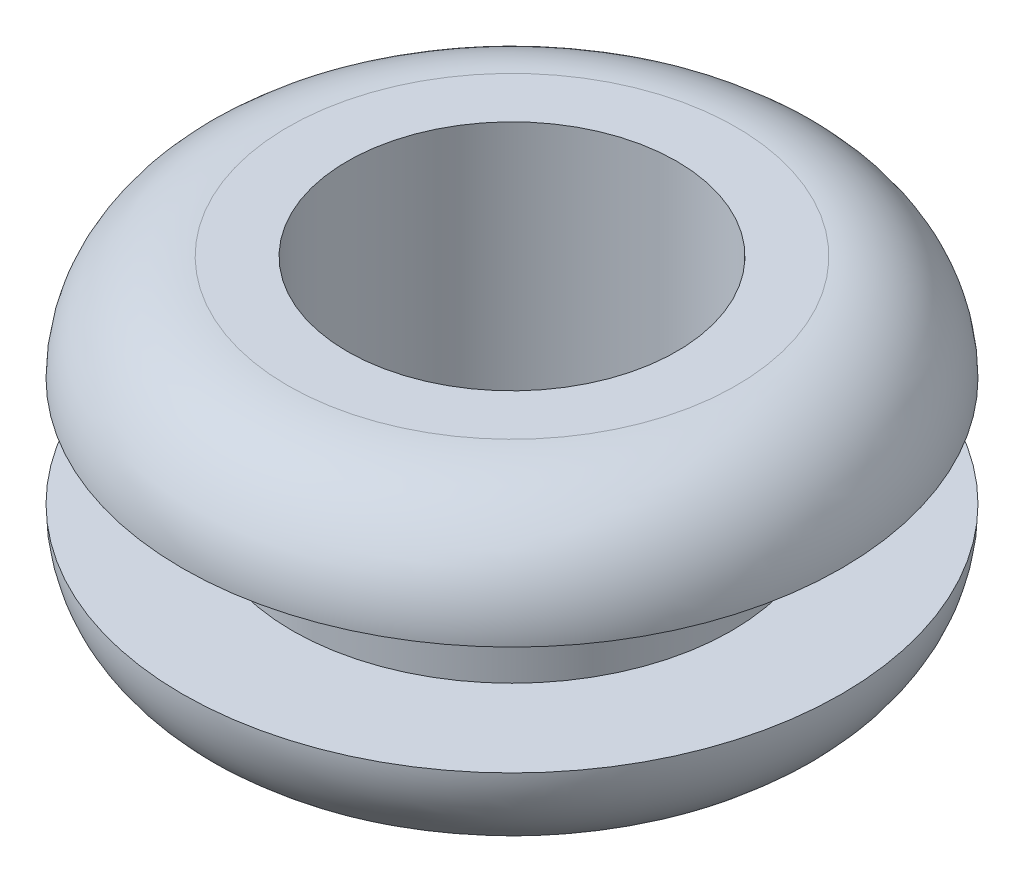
ISO-10303-21;
HEADER;
FILE_DESCRIPTION(('STEP AP214'),'2;1');
FILE_NAME('part.step','',(''),(''),'','','');
FILE_SCHEMA(('AUTOMOTIVE_DESIGN { 1 0 10303 214 1 1 1 1 }'));
ENDSEC;
DATA;
#1=APPLICATION_CONTEXT('core data for automotive mechanical design processes');
#2=APPLICATION_PROTOCOL_DEFINITION('international standard','automotive_design',2000,#1);
#3=PRODUCT_CONTEXT('',#1,'mechanical');
#4=PRODUCT('Part','Part','',(#3));
#5=PRODUCT_RELATED_PRODUCT_CATEGORY('part','',(#4));
#6=PRODUCT_DEFINITION_FORMATION('','',#4);
#7=PRODUCT_DEFINITION_CONTEXT('part definition',#1,'design');
#8=PRODUCT_DEFINITION('design','',#6,#7);
#9=PRODUCT_DEFINITION_SHAPE('','',#8);
#10=(LENGTH_UNIT() NAMED_UNIT(*) SI_UNIT(.MILLI.,.METRE.));
#11=(NAMED_UNIT(*) PLANE_ANGLE_UNIT() SI_UNIT($,.RADIAN.));
#12=(NAMED_UNIT(*) SI_UNIT($,.STERADIAN.) SOLID_ANGLE_UNIT());
#13=UNCERTAINTY_MEASURE_WITH_UNIT(LENGTH_MEASURE(1.E-05),#10,'distance_accuracy_value','');
#14=(GEOMETRIC_REPRESENTATION_CONTEXT(3) GLOBAL_UNCERTAINTY_ASSIGNED_CONTEXT((#13)) GLOBAL_UNIT_ASSIGNED_CONTEXT((#10,
#11,#12)) REPRESENTATION_CONTEXT('',''));
#15=CARTESIAN_POINT('',(0.,0.,0.));
#16=DIRECTION('',(0.,0.,1.));
#17=DIRECTION('',(1.,0.,0.));
#18=AXIS2_PLACEMENT_3D('',#15,#16,#17);
#19=CARTESIAN_POINT('',(0.,-2.3114,-4.7625));
#20=DIRECTION('',(0.,-1.,0.));
#21=DIRECTION('',(0.,0.,-1.));
#22=AXIS2_PLACEMENT_3D('',#19,#20,#21);
#23=PLANE('',#22);
#24=CARTESIAN_POINT('',(0.,-2.3114,0.));
#25=DIRECTION('',(0.,1.,0.));
#26=DIRECTION('',(0.,0.,1.));
#27=AXIS2_PLACEMENT_3D('',#24,#25,#26);
#28=CIRCLE('',#27,2.38125);
#29=CARTESIAN_POINT('',(0.,-2.3114,2.38125));
#30=VERTEX_POINT('',#29);
#31=EDGE_CURVE('E57',#30,#30,#28,.T.);
#32=ORIENTED_EDGE('',*,*,#31,.T.);
#33=EDGE_LOOP('',(#32));
#34=FACE_BOUND('',#33,.T.);
#35=CARTESIAN_POINT('',(0.,-2.3114,0.));
#36=DIRECTION('',(0.,-1.,0.));
#37=DIRECTION('',(0.,0.,-1.));
#38=AXIS2_PLACEMENT_3D('',#35,#36,#37);
#39=CIRCLE('',#38,3.2385);
#40=CARTESIAN_POINT('',(0.,-2.3114,-3.2385));
#41=VERTEX_POINT('',#40);
#42=EDGE_CURVE('E38',#41,#41,#39,.T.);
#43=ORIENTED_EDGE('',*,*,#42,.T.);
#44=EDGE_LOOP('',(#43));
#45=FACE_BOUND('',#44,.T.);
#46=ADVANCED_FACE('F31',(#34,#45),#23,.T.);
#47=CARTESIAN_POINT('',(0.,-0.7874,0.));
#48=DIRECTION('',(0.,-1.,0.));
#49=DIRECTION('',(0.,0.,-1.));
#50=AXIS2_PLACEMENT_3D('',#47,#48,#49);
#51=TOROIDAL_SURFACE('',#50,3.2385,1.524);
#52=CARTESIAN_POINT('',(0.,-0.7874,0.));
#53=DIRECTION('',(0.,-1.,0.));
#54=DIRECTION('',(0.,0.,-1.));
#55=AXIS2_PLACEMENT_3D('',#52,#53,#54);
#56=CIRCLE('',#55,4.7625);
#57=CARTESIAN_POINT('',(0.,-0.7874,-4.7625));
#58=VERTEX_POINT('',#57);
#59=EDGE_CURVE('E42',#58,#58,#56,.T.);
#60=ORIENTED_EDGE('',*,*,#59,.T.);
#61=EDGE_LOOP('',(#60));
#62=FACE_BOUND('',#61,.T.);
#63=ORIENTED_EDGE('',*,*,#42,.F.);
#64=EDGE_LOOP('',(#63));
#65=FACE_BOUND('',#64,.T.);
#66=ADVANCED_FACE('F86',(#62,#65),#51,.T.);
#67=CARTESIAN_POINT('',(0.,-0.7874,-3.175));
#68=DIRECTION('',(0.,-1.,0.));
#69=DIRECTION('',(0.,0.,-1.));
#70=AXIS2_PLACEMENT_3D('',#67,#68,#69);
#71=PLANE('',#70);
#72=ORIENTED_EDGE('',*,*,#59,.F.);
#73=EDGE_LOOP('',(#72));
#74=FACE_BOUND('',#73,.T.);
#75=CARTESIAN_POINT('',(0.,-0.7874,0.));
#76=DIRECTION('',(0.,-1.,0.));
#77=DIRECTION('',(0.,0.,-1.));
#78=AXIS2_PLACEMENT_3D('',#75,#76,#77);
#79=CIRCLE('',#78,3.175);
#80=CARTESIAN_POINT('',(0.,-0.7874,-3.175));
#81=VERTEX_POINT('',#80);
#82=EDGE_CURVE('E46',#81,#81,#79,.T.);
#83=ORIENTED_EDGE('',*,*,#82,.T.);
#84=EDGE_LOOP('',(#83));
#85=FACE_BOUND('',#84,.T.);
#86=ADVANCED_FACE('F90',(#74,#85),#71,.F.);
#87=CARTESIAN_POINT('',(0.,0.,0.));
#88=DIRECTION('',(0.,-1.,0.));
#89=DIRECTION('',(0.,0.,-1.));
#90=AXIS2_PLACEMENT_3D('',#87,#88,#89);
#91=CYLINDRICAL_SURFACE('',#90,3.175);
#92=ORIENTED_EDGE('',*,*,#82,.F.);
#93=EDGE_LOOP('',(#92));
#94=FACE_BOUND('',#93,.T.);
#95=CARTESIAN_POINT('',(0.,0.7874,0.));
#96=DIRECTION('',(0.,-1.,0.));
#97=DIRECTION('',(0.,0.,-1.));
#98=AXIS2_PLACEMENT_3D('',#95,#96,#97);
#99=CIRCLE('',#98,3.175);
#100=CARTESIAN_POINT('',(0.,0.7874,-3.175));
#101=VERTEX_POINT('',#100);
#102=EDGE_CURVE('E51',#101,#101,#99,.T.);
#103=ORIENTED_EDGE('',*,*,#102,.T.);
#104=EDGE_LOOP('',(#103));
#105=FACE_BOUND('',#104,.T.);
#106=ADVANCED_FACE('F80',(#94,#105),#91,.T.);
#107=CARTESIAN_POINT('',(0.,0.7874,-3.175));
#108=DIRECTION('',(0.,1.,0.));
#109=DIRECTION('',(0.,0.,1.));
#110=AXIS2_PLACEMENT_3D('',#107,#108,#109);
#111=PLANE('',#110);
#112=ORIENTED_EDGE('',*,*,#102,.F.);
#113=EDGE_LOOP('',(#112));
#114=FACE_BOUND('',#113,.T.);
#115=CARTESIAN_POINT('',(0.,0.7874,0.));
#116=DIRECTION('',(0.,-1.,0.));
#117=DIRECTION('',(0.,0.,-1.));
#118=AXIS2_PLACEMENT_3D('',#115,#116,#117);
#119=CIRCLE('',#118,4.7625);
#120=CARTESIAN_POINT('',(0.,0.7874,-4.7625));
#121=VERTEX_POINT('',#120);
#122=EDGE_CURVE('E54',#121,#121,#119,.T.);
#123=ORIENTED_EDGE('',*,*,#122,.T.);
#124=EDGE_LOOP('',(#123));
#125=FACE_BOUND('',#124,.T.);
#126=ADVANCED_FACE('F73',(#114,#125),#111,.F.);
#127=CARTESIAN_POINT('',(0.,2.3114,-4.7625));
#128=DIRECTION('',(0.,1.,0.));
#129=DIRECTION('',(0.,0.,1.));
#130=AXIS2_PLACEMENT_3D('',#127,#128,#129);
#131=PLANE('',#130);
#132=CARTESIAN_POINT('',(0.,2.3114,0.));
#133=DIRECTION('',(0.,1.,0.));
#134=DIRECTION('',(0.,0.,1.));
#135=AXIS2_PLACEMENT_3D('',#132,#133,#134);
#136=CIRCLE('',#135,2.38125);
#137=CARTESIAN_POINT('',(0.,2.3114,2.38125));
#138=VERTEX_POINT('',#137);
#139=EDGE_CURVE('E58',#138,#138,#136,.T.);
#140=ORIENTED_EDGE('',*,*,#139,.F.);
#141=EDGE_LOOP('',(#140));
#142=FACE_BOUND('',#141,.T.);
#143=CARTESIAN_POINT('',(0.,2.3114,0.));
#144=DIRECTION('',(0.,1.,0.));
#145=DIRECTION('',(0.,0.,1.));
#146=AXIS2_PLACEMENT_3D('',#143,#144,#145);
#147=CIRCLE('',#146,3.2385);
#148=CARTESIAN_POINT('',(0.,2.3114,3.2385));
#149=VERTEX_POINT('',#148);
#150=EDGE_CURVE('E10',#149,#149,#147,.T.);
#151=ORIENTED_EDGE('',*,*,#150,.T.);
#152=EDGE_LOOP('',(#151));
#153=FACE_BOUND('',#152,.T.);
#154=ADVANCED_FACE('F71',(#142,#153),#131,.T.);
#155=CARTESIAN_POINT('',(0.,0.7874,0.));
#156=DIRECTION('',(0.,1.,0.));
#157=DIRECTION('',(0.,0.,1.));
#158=AXIS2_PLACEMENT_3D('',#155,#156,#157);
#159=TOROIDAL_SURFACE('',#158,3.2385,1.524);
#160=ORIENTED_EDGE('',*,*,#150,.F.);
#161=EDGE_LOOP('',(#160));
#162=FACE_BOUND('',#161,.T.);
#163=ORIENTED_EDGE('',*,*,#122,.F.);
#164=EDGE_LOOP('',(#163));
#165=FACE_BOUND('',#164,.T.);
#166=ADVANCED_FACE('F33',(#162,#165),#159,.T.);
#167=CARTESIAN_POINT('',(0.,-2.3114,0.));
#168=DIRECTION('',(0.,1.,0.));
#169=DIRECTION('',(0.,0.,1.));
#170=AXIS2_PLACEMENT_3D('',#167,#168,#169);
#171=CYLINDRICAL_SURFACE('',#170,2.38125);
#172=ORIENTED_EDGE('',*,*,#31,.F.);
#173=EDGE_LOOP('',(#172));
#174=FACE_BOUND('',#173,.T.);
#175=ORIENTED_EDGE('',*,*,#139,.T.);
#176=EDGE_LOOP('',(#175));
#177=FACE_BOUND('',#176,.T.);
#178=ADVANCED_FACE('F65',(#174,#177),#171,.F.);
#179=CLOSED_SHELL('',(#46,#66,#86,#106,#126,#154,#166,#178));
#180=MANIFOLD_SOLID_BREP('B2',#179);
#181=ADVANCED_BREP_SHAPE_REPRESENTATION('',(#18,#180),#14);
#182=SHAPE_DEFINITION_REPRESENTATION(#9,#181);
ENDSEC;
END-ISO-10303-21;
